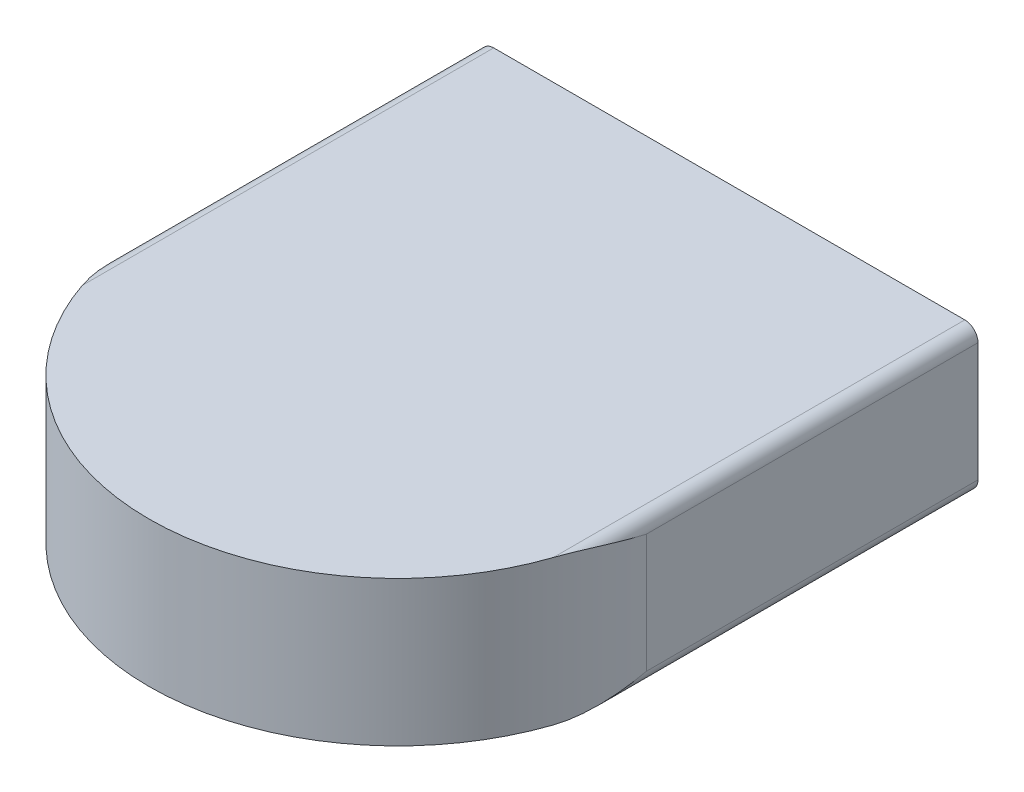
ISO-10303-21;
HEADER;
FILE_DESCRIPTION(('STEP AP214'),'2;1');
FILE_NAME('part.step','',(''),(''),'','','');
FILE_SCHEMA(('AUTOMOTIVE_DESIGN { 1 0 10303 214 1 1 1 1 }'));
ENDSEC;
DATA;
#1=APPLICATION_CONTEXT('core data for automotive mechanical design processes');
#2=APPLICATION_PROTOCOL_DEFINITION('international standard','automotive_design',2000,#1);
#3=PRODUCT_CONTEXT('',#1,'mechanical');
#4=PRODUCT('Part','Part','',(#3));
#5=PRODUCT_RELATED_PRODUCT_CATEGORY('part','',(#4));
#6=PRODUCT_DEFINITION_FORMATION('','',#4);
#7=PRODUCT_DEFINITION_CONTEXT('part definition',#1,'design');
#8=PRODUCT_DEFINITION('design','',#6,#7);
#9=PRODUCT_DEFINITION_SHAPE('','',#8);
#10=(LENGTH_UNIT() NAMED_UNIT(*) SI_UNIT(.MILLI.,.METRE.));
#11=(NAMED_UNIT(*) PLANE_ANGLE_UNIT() SI_UNIT($,.RADIAN.));
#12=(NAMED_UNIT(*) SI_UNIT($,.STERADIAN.) SOLID_ANGLE_UNIT());
#13=UNCERTAINTY_MEASURE_WITH_UNIT(LENGTH_MEASURE(1.E-05),#10,'distance_accuracy_value','');
#14=(GEOMETRIC_REPRESENTATION_CONTEXT(3) GLOBAL_UNCERTAINTY_ASSIGNED_CONTEXT((#13)) GLOBAL_UNIT_ASSIGNED_CONTEXT((#10,
#11,#12)) REPRESENTATION_CONTEXT('',''));
#15=CARTESIAN_POINT('',(0.,0.,0.));
#16=DIRECTION('',(0.,0.,1.));
#17=DIRECTION('',(1.,0.,0.));
#18=AXIS2_PLACEMENT_3D('',#15,#16,#17);
#19=CARTESIAN_POINT('',(-30.,8.75,0.));
#20=DIRECTION('',(1.,0.,0.));
#21=DIRECTION('',(0.,0.,-1.));
#22=AXIS2_PLACEMENT_3D('',#19,#20,#21);
#23=PLANE('',#22);
#24=DIRECTION('',(0.,-1.,0.));
#25=VECTOR('',#24,1.);
#26=CARTESIAN_POINT('',(-30.,8.75,0.));
#27=LINE('',#26,#25);
#28=CARTESIAN_POINT('',(-30.,7.16199999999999,0.));
#29=VERTEX_POINT('',#28);
#30=CARTESIAN_POINT('',(-30.,-7.16199999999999,0.));
#31=VERTEX_POINT('',#30);
#32=EDGE_CURVE('E126',#29,#31,#27,.T.);
#33=ORIENTED_EDGE('',*,*,#32,.F.);
#34=DIRECTION('',(0.,0.,-1.));
#35=VECTOR('',#34,1.);
#36=CARTESIAN_POINT('',(-30.,7.16199999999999,30.));
#37=LINE('',#36,#35);
#38=CARTESIAN_POINT('',(-30.,7.16199999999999,-40.));
#39=VERTEX_POINT('',#38);
#40=EDGE_CURVE('E195',#29,#39,#37,.T.);
#41=ORIENTED_EDGE('',*,*,#40,.T.);
#42=DIRECTION('',(0.,-1.,0.));
#43=VECTOR('',#42,1.);
#44=CARTESIAN_POINT('',(-30.,8.75,-40.));
#45=LINE('',#44,#43);
#46=CARTESIAN_POINT('',(-30.,-7.16199999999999,-40.));
#47=VERTEX_POINT('',#46);
#48=EDGE_CURVE('E124',#39,#47,#45,.T.);
#49=ORIENTED_EDGE('',*,*,#48,.T.);
#50=DIRECTION('',(0.,0.,-1.));
#51=VECTOR('',#50,1.);
#52=CARTESIAN_POINT('',(-30.,-7.16199999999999,30.));
#53=LINE('',#52,#51);
#54=EDGE_CURVE('E119',#31,#47,#53,.T.);
#55=ORIENTED_EDGE('',*,*,#54,.F.);
#56=EDGE_LOOP('',(#33,#41,#49,#55));
#57=FACE_BOUND('',#56,.T.);
#58=ADVANCED_FACE('F34',(#57),#23,.F.);
#59=CARTESIAN_POINT('',(0.,8.75,0.));
#60=DIRECTION('',(0.,-1.,0.));
#61=DIRECTION('',(0.,0.,-1.));
#62=AXIS2_PLACEMENT_3D('',#59,#60,#61);
#63=CYLINDRICAL_SURFACE('',#62,30.);
#64=CARTESIAN_POINT('',(28.412,8.75,9.6311087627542));
#65=CARTESIAN_POINT('',(28.4547860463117,8.74999138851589,9.50489015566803));
#66=CARTESIAN_POINT('',(28.4967260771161,8.74827185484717,9.37839837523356));
#67=CARTESIAN_POINT('',(28.5788900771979,8.74174540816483,9.12495376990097));
#68=CARTESIAN_POINT('',(28.61911425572,8.7369388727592,8.99800100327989));
#69=CARTESIAN_POINT('',(28.7371358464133,8.71839852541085,8.61671532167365));
#70=CARTESIAN_POINT('',(28.8123437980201,8.70054299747,8.36177360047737));
#71=CARTESIAN_POINT('',(28.9556722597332,8.65591635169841,7.85107071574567));
#72=CARTESIAN_POINT('',(29.0238017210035,8.62915667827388,7.59531101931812));
#73=CARTESIAN_POINT('',(29.1530979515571,8.5682800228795,7.08284773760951));
#74=CARTESIAN_POINT('',(29.2142628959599,8.53416111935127,6.8261439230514));
#75=CARTESIAN_POINT('',(29.3326636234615,8.45789308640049,6.29854986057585));
#76=CARTESIAN_POINT('',(29.3895239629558,8.41541616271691,6.02762307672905));
#77=CARTESIAN_POINT('',(29.4955788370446,8.32495120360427,5.48518145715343));
#78=CARTESIAN_POINT('',(29.544772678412,8.27696267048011,5.21366657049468));
#79=CARTESIAN_POINT('',(29.6809486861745,8.1262956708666,4.3982996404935));
#80=CARTESIAN_POINT('',(29.7565012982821,8.0169321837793,3.8537327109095));
#81=CARTESIAN_POINT('',(29.8774945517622,7.78723649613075,2.76340708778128));
#82=CARTESIAN_POINT('',(29.9229206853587,7.66689904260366,2.2176479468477));
#83=CARTESIAN_POINT('',(29.9838509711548,7.42096935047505,1.12580981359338));
#84=CARTESIAN_POINT('',(29.9993666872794,7.29537916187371,0.579731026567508));
#85=CARTESIAN_POINT('',(29.9999936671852,7.16717800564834,0.0225059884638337));
#86=CARTESIAN_POINT('',(29.9999999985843,7.16458899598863,0.0112529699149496));
#87=CARTESIAN_POINT('',(30.,7.162,0.));
#88=B_SPLINE_CURVE_WITH_KNOTS('',3,(#64,#65,#66,#67,#68,#69,#70,#71,#72,#73,#74,#75,#76,#77,#78,
#79,#80,#81,#82,#83,#84,#85,#86,#87),.UNSPECIFIED.,.F.,.F.,(4,2,2,2,2,2,2,2,2,2,2,4),(0.,
0.399785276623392,0.799521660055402,1.59842041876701,2.39629630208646,3.19438077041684,
4.03440912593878,4.87451339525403,6.55505507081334,8.23640544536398,9.91710564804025,
9.95174666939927),.UNSPECIFIED.);
#89=CARTESIAN_POINT('',(28.412,8.75,9.63110876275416));
#90=VERTEX_POINT('',#89);
#91=CARTESIAN_POINT('',(30.,7.16199999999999,0.));
#92=VERTEX_POINT('',#91);
#93=EDGE_CURVE('E156',#90,#92,#88,.T.);
#94=ORIENTED_EDGE('',*,*,#93,.F.);
#95=CARTESIAN_POINT('',(0.,8.75,0.));
#96=DIRECTION('',(0.,1.,0.));
#97=DIRECTION('',(0.,0.,-1.));
#98=AXIS2_PLACEMENT_3D('',#95,#96,#97);
#99=CIRCLE('',#98,30.);
#100=CARTESIAN_POINT('',(-28.412,8.75,9.63110876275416));
#101=VERTEX_POINT('',#100);
#102=EDGE_CURVE('E149',#101,#90,#99,.T.);
#103=ORIENTED_EDGE('',*,*,#102,.F.);
#104=CARTESIAN_POINT('',(-28.412,8.75,9.6311087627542));
#105=CARTESIAN_POINT('',(-28.4547860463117,8.74999138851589,9.50489015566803));
#106=CARTESIAN_POINT('',(-28.4967260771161,8.74827185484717,9.37839837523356));
#107=CARTESIAN_POINT('',(-28.5788900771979,8.74174540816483,9.12495376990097));
#108=CARTESIAN_POINT('',(-28.61911425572,8.7369388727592,8.99800100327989));
#109=CARTESIAN_POINT('',(-28.7371358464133,8.71839852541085,8.61671532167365));
#110=CARTESIAN_POINT('',(-28.8123437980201,8.70054299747,8.36177360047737));
#111=CARTESIAN_POINT('',(-28.9556722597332,8.65591635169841,7.85107071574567));
#112=CARTESIAN_POINT('',(-29.0238017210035,8.62915667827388,7.59531101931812));
#113=CARTESIAN_POINT('',(-29.1530979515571,8.5682800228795,7.08284773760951));
#114=CARTESIAN_POINT('',(-29.2142628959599,8.53416111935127,6.8261439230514));
#115=CARTESIAN_POINT('',(-29.3326636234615,8.45789308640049,6.29854986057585));
#116=CARTESIAN_POINT('',(-29.3895239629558,8.41541616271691,6.02762307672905));
#117=CARTESIAN_POINT('',(-29.4955788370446,8.32495120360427,5.48518145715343));
#118=CARTESIAN_POINT('',(-29.544772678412,8.27696267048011,5.21366657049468));
#119=CARTESIAN_POINT('',(-29.6809486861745,8.1262956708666,4.3982996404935));
#120=CARTESIAN_POINT('',(-29.7565012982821,8.0169321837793,3.8537327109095));
#121=CARTESIAN_POINT('',(-29.8774945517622,7.78723649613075,2.76340708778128));
#122=CARTESIAN_POINT('',(-29.9229206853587,7.66689904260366,2.2176479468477));
#123=CARTESIAN_POINT('',(-29.9838509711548,7.42096935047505,1.12580981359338));
#124=CARTESIAN_POINT('',(-29.9993666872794,7.29537916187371,0.579731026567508));
#125=CARTESIAN_POINT('',(-29.9999936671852,7.16717800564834,0.0225059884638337));
#126=CARTESIAN_POINT('',(-29.9999999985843,7.16458899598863,0.0112529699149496));
#127=CARTESIAN_POINT('',(-30.,7.162,0.));
#128=B_SPLINE_CURVE_WITH_KNOTS('',3,(#104,#105,#106,#107,#108,#109,#110,#111,#112,#113,#114,
#115,#116,#117,#118,#119,#120,#121,#122,#123,#124,#125,#126,#127),.UNSPECIFIED.,.F.,.F.,(4,2,2,
2,2,2,2,2,2,2,2,4),(0.,0.399785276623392,0.799521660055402,1.59842041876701,2.39629630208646,
3.19438077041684,4.03440912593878,4.87451339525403,6.55505507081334,8.23640544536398,
9.91710564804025,9.95174666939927),.UNSPECIFIED.);
#129=EDGE_CURVE('E55',#29,#101,#128,.F.);
#130=ORIENTED_EDGE('',*,*,#129,.F.);
#131=ORIENTED_EDGE('',*,*,#32,.T.);
#132=CARTESIAN_POINT('',(-28.412,-8.75,9.6311087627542));
#133=CARTESIAN_POINT('',(-28.4547860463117,-8.74999138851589,9.50489015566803));
#134=CARTESIAN_POINT('',(-28.4967260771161,-8.74827185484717,9.37839837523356));
#135=CARTESIAN_POINT('',(-28.5788900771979,-8.74174540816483,9.12495376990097));
#136=CARTESIAN_POINT('',(-28.61911425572,-8.7369388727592,8.99800100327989));
#137=CARTESIAN_POINT('',(-28.7371358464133,-8.71839852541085,8.61671532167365));
#138=CARTESIAN_POINT('',(-28.8123437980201,-8.70054299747,8.36177360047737));
#139=CARTESIAN_POINT('',(-28.9556722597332,-8.65591635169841,7.85107071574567));
#140=CARTESIAN_POINT('',(-29.0238017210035,-8.62915667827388,7.59531101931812));
#141=CARTESIAN_POINT('',(-29.1530979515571,-8.5682800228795,7.08284773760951));
#142=CARTESIAN_POINT('',(-29.2142628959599,-8.53416111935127,6.8261439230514));
#143=CARTESIAN_POINT('',(-29.3326636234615,-8.45789308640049,6.29854986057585));
#144=CARTESIAN_POINT('',(-29.3895239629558,-8.41541616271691,6.02762307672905));
#145=CARTESIAN_POINT('',(-29.4955788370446,-8.32495120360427,5.48518145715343));
#146=CARTESIAN_POINT('',(-29.544772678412,-8.27696267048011,5.21366657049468));
#147=CARTESIAN_POINT('',(-29.6809486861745,-8.1262956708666,4.3982996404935));
#148=CARTESIAN_POINT('',(-29.7565012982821,-8.0169321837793,3.8537327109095));
#149=CARTESIAN_POINT('',(-29.8774945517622,-7.78723649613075,2.76340708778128));
#150=CARTESIAN_POINT('',(-29.9229206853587,-7.66689904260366,2.2176479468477));
#151=CARTESIAN_POINT('',(-29.9838509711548,-7.42096935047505,1.12580981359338));
#152=CARTESIAN_POINT('',(-29.9993666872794,-7.29537916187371,0.579731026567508));
#153=CARTESIAN_POINT('',(-29.9999936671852,-7.16717800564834,0.0225059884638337));
#154=CARTESIAN_POINT('',(-29.9999999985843,-7.16458899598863,0.0112529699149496));
#155=CARTESIAN_POINT('',(-30.,-7.162,0.));
#156=B_SPLINE_CURVE_WITH_KNOTS('',3,(#132,#133,#134,#135,#136,#137,#138,#139,#140,#141,#142,
#143,#144,#145,#146,#147,#148,#149,#150,#151,#152,#153,#154,#155),.UNSPECIFIED.,.F.,.F.,(4,2,2,
2,2,2,2,2,2,2,2,4),(0.,0.399785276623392,0.799521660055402,1.59842041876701,2.39629630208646,
3.19438077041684,4.03440912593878,4.87451339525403,6.55505507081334,8.23640544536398,
9.91710564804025,9.95174666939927),.UNSPECIFIED.);
#157=CARTESIAN_POINT('',(-28.412,-8.75,9.63110876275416));
#158=VERTEX_POINT('',#157);
#159=EDGE_CURVE('E198',#158,#31,#156,.T.);
#160=ORIENTED_EDGE('',*,*,#159,.F.);
#161=CARTESIAN_POINT('',(0.,-8.75,0.));
#162=DIRECTION('',(0.,1.,0.));
#163=DIRECTION('',(0.,0.,-1.));
#164=AXIS2_PLACEMENT_3D('',#161,#162,#163);
#165=CIRCLE('',#164,30.);
#166=CARTESIAN_POINT('',(28.412,-8.75,9.63110876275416));
#167=VERTEX_POINT('',#166);
#168=EDGE_CURVE('E154',#158,#167,#165,.T.);
#169=ORIENTED_EDGE('',*,*,#168,.T.);
#170=CARTESIAN_POINT('',(28.412,-8.75,9.6311087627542));
#171=CARTESIAN_POINT('',(28.4547860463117,-8.74999138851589,9.50489015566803));
#172=CARTESIAN_POINT('',(28.4967260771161,-8.74827185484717,9.37839837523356));
#173=CARTESIAN_POINT('',(28.5788900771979,-8.74174540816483,9.12495376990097));
#174=CARTESIAN_POINT('',(28.61911425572,-8.7369388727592,8.99800100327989));
#175=CARTESIAN_POINT('',(28.7371358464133,-8.71839852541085,8.61671532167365));
#176=CARTESIAN_POINT('',(28.8123437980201,-8.70054299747,8.36177360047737));
#177=CARTESIAN_POINT('',(28.9556722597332,-8.65591635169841,7.85107071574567));
#178=CARTESIAN_POINT('',(29.0238017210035,-8.62915667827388,7.59531101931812));
#179=CARTESIAN_POINT('',(29.1530979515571,-8.5682800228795,7.08284773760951));
#180=CARTESIAN_POINT('',(29.2142628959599,-8.53416111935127,6.8261439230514));
#181=CARTESIAN_POINT('',(29.3326636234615,-8.45789308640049,6.29854986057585));
#182=CARTESIAN_POINT('',(29.3895239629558,-8.41541616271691,6.02762307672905));
#183=CARTESIAN_POINT('',(29.4955788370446,-8.32495120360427,5.48518145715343));
#184=CARTESIAN_POINT('',(29.544772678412,-8.27696267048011,5.21366657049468));
#185=CARTESIAN_POINT('',(29.6809486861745,-8.1262956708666,4.3982996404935));
#186=CARTESIAN_POINT('',(29.7565012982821,-8.0169321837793,3.8537327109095));
#187=CARTESIAN_POINT('',(29.8774945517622,-7.78723649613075,2.76340708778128));
#188=CARTESIAN_POINT('',(29.9229206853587,-7.66689904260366,2.2176479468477));
#189=CARTESIAN_POINT('',(29.9838509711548,-7.42096935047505,1.12580981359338));
#190=CARTESIAN_POINT('',(29.9993666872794,-7.29537916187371,0.579731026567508));
#191=CARTESIAN_POINT('',(29.9999936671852,-7.16717800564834,0.0225059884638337));
#192=CARTESIAN_POINT('',(29.9999999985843,-7.16458899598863,0.0112529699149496));
#193=CARTESIAN_POINT('',(30.,-7.162,0.));
#194=B_SPLINE_CURVE_WITH_KNOTS('',3,(#170,#171,#172,#173,#174,#175,#176,#177,#178,#179,#180,
#181,#182,#183,#184,#185,#186,#187,#188,#189,#190,#191,#192,#193),.UNSPECIFIED.,.F.,.F.,(4,2,2,
2,2,2,2,2,2,2,2,4),(0.,0.399785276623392,0.799521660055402,1.59842041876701,2.39629630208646,
3.19438077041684,4.03440912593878,4.87451339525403,6.55505507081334,8.23640544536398,
9.91710564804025,9.95174666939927),.UNSPECIFIED.);
#195=CARTESIAN_POINT('',(30.,-7.16199999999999,0.));
#196=VERTEX_POINT('',#195);
#197=EDGE_CURVE('E200',#196,#167,#194,.F.);
#198=ORIENTED_EDGE('',*,*,#197,.F.);
#199=DIRECTION('',(0.,-1.,0.));
#200=VECTOR('',#199,1.);
#201=CARTESIAN_POINT('',(30.,8.75,0.));
#202=LINE('',#201,#200);
#203=EDGE_CURVE('E118',#92,#196,#202,.T.);
#204=ORIENTED_EDGE('',*,*,#203,.F.);
#205=EDGE_LOOP('',(#94,#103,#130,#131,#160,#169,#198,#204));
#206=FACE_BOUND('',#205,.T.);
#207=ADVANCED_FACE('F167',(#206),#63,.T.);
#208=CARTESIAN_POINT('',(30.,8.75,-40.));
#209=DIRECTION('',(-1.,0.,0.));
#210=DIRECTION('',(0.,0.,1.));
#211=AXIS2_PLACEMENT_3D('',#208,#209,#210);
#212=PLANE('',#211);
#213=DIRECTION('',(0.,0.,-1.));
#214=VECTOR('',#213,1.);
#215=CARTESIAN_POINT('',(30.,7.16199999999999,30.));
#216=LINE('',#215,#214);
#217=CARTESIAN_POINT('',(30.,7.16199999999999,-40.));
#218=VERTEX_POINT('',#217);
#219=EDGE_CURVE('E120',#92,#218,#216,.T.);
#220=ORIENTED_EDGE('',*,*,#219,.F.);
#221=ORIENTED_EDGE('',*,*,#203,.T.);
#222=DIRECTION('',(0.,0.,-1.));
#223=VECTOR('',#222,1.);
#224=CARTESIAN_POINT('',(30.,-7.16199999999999,30.));
#225=LINE('',#224,#223);
#226=CARTESIAN_POINT('',(30.,-7.16199999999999,-40.));
#227=VERTEX_POINT('',#226);
#228=EDGE_CURVE('E101',#196,#227,#225,.T.);
#229=ORIENTED_EDGE('',*,*,#228,.T.);
#230=DIRECTION('',(0.,-1.,0.));
#231=VECTOR('',#230,1.);
#232=CARTESIAN_POINT('',(30.,8.75,-40.));
#233=LINE('',#232,#231);
#234=EDGE_CURVE('E116',#218,#227,#233,.T.);
#235=ORIENTED_EDGE('',*,*,#234,.F.);
#236=EDGE_LOOP('',(#220,#221,#229,#235));
#237=FACE_BOUND('',#236,.T.);
#238=ADVANCED_FACE('F115',(#237),#212,.F.);
#239=CARTESIAN_POINT('',(-30.,8.75,-40.));
#240=DIRECTION('',(0.,0.,1.));
#241=DIRECTION('',(1.,0.,0.));
#242=AXIS2_PLACEMENT_3D('',#239,#240,#241);
#243=PLANE('',#242);
#244=CARTESIAN_POINT('',(28.412,7.162,-40.));
#245=DIRECTION('',(0.,0.,-1.));
#246=DIRECTION('',(-1.,0.,0.));
#247=AXIS2_PLACEMENT_3D('',#244,#245,#246);
#248=CIRCLE('',#247,1.588);
#249=CARTESIAN_POINT('',(28.412,8.75,-40.));
#250=VERTEX_POINT('',#249);
#251=EDGE_CURVE('E48',#250,#218,#248,.T.);
#252=ORIENTED_EDGE('',*,*,#251,.T.);
#253=ORIENTED_EDGE('',*,*,#234,.T.);
#254=CARTESIAN_POINT('',(28.412,-7.162,-40.));
#255=DIRECTION('',(0.,0.,-1.));
#256=DIRECTION('',(-1.,0.,0.));
#257=AXIS2_PLACEMENT_3D('',#254,#255,#256);
#258=CIRCLE('',#257,1.588);
#259=CARTESIAN_POINT('',(28.412,-8.75,-40.));
#260=VERTEX_POINT('',#259);
#261=EDGE_CURVE('E97',#227,#260,#258,.T.);
#262=ORIENTED_EDGE('',*,*,#261,.T.);
#263=DIRECTION('',(-1.,0.,0.));
#264=VECTOR('',#263,1.);
#265=CARTESIAN_POINT('',(-30.,-8.75,-40.));
#266=LINE('',#265,#264);
#267=CARTESIAN_POINT('',(-28.412,-8.75,-40.));
#268=VERTEX_POINT('',#267);
#269=EDGE_CURVE('E150',#260,#268,#266,.T.);
#270=ORIENTED_EDGE('',*,*,#269,.T.);
#271=CARTESIAN_POINT('',(-28.412,-7.162,-40.));
#272=DIRECTION('',(0.,0.,-1.));
#273=DIRECTION('',(-1.,0.,0.));
#274=AXIS2_PLACEMENT_3D('',#271,#272,#273);
#275=CIRCLE('',#274,1.588);
#276=EDGE_CURVE('E109',#268,#47,#275,.T.);
#277=ORIENTED_EDGE('',*,*,#276,.T.);
#278=ORIENTED_EDGE('',*,*,#48,.F.);
#279=CARTESIAN_POINT('',(-28.412,7.162,-40.));
#280=DIRECTION('',(0.,0.,-1.));
#281=DIRECTION('',(1.,0.,0.));
#282=AXIS2_PLACEMENT_3D('',#279,#280,#281);
#283=CIRCLE('',#282,1.588);
#284=CARTESIAN_POINT('',(-28.412,8.75,-40.));
#285=VERTEX_POINT('',#284);
#286=EDGE_CURVE('E140',#39,#285,#283,.T.);
#287=ORIENTED_EDGE('',*,*,#286,.T.);
#288=DIRECTION('',(-1.,0.,0.));
#289=VECTOR('',#288,1.);
#290=CARTESIAN_POINT('',(-30.,8.75,-40.));
#291=LINE('',#290,#289);
#292=EDGE_CURVE('E129',#250,#285,#291,.T.);
#293=ORIENTED_EDGE('',*,*,#292,.F.);
#294=EDGE_LOOP('',(#252,#253,#262,#270,#277,#278,#287,#293));
#295=FACE_BOUND('',#294,.T.);
#296=ADVANCED_FACE('F122',(#295),#243,.F.);
#297=CARTESIAN_POINT('',(0.,8.75,0.));
#298=DIRECTION('',(0.,-1.,0.));
#299=DIRECTION('',(0.,0.,-1.));
#300=AXIS2_PLACEMENT_3D('',#297,#298,#299);
#301=PLANE('',#300);
#302=ORIENTED_EDGE('',*,*,#102,.T.);
#303=DIRECTION('',(0.,0.,-1.));
#304=VECTOR('',#303,1.);
#305=CARTESIAN_POINT('',(28.412,8.75,30.));
#306=LINE('',#305,#304);
#307=EDGE_CURVE('E12',#90,#250,#306,.T.);
#308=ORIENTED_EDGE('',*,*,#307,.T.);
#309=ORIENTED_EDGE('',*,*,#292,.T.);
#310=DIRECTION('',(0.,0.,-1.));
#311=VECTOR('',#310,1.);
#312=CARTESIAN_POINT('',(-28.412,8.75,30.));
#313=LINE('',#312,#311);
#314=EDGE_CURVE('E41',#101,#285,#313,.T.);
#315=ORIENTED_EDGE('',*,*,#314,.F.);
#316=EDGE_LOOP('',(#302,#308,#309,#315));
#317=FACE_BOUND('',#316,.T.);
#318=ADVANCED_FACE('F148',(#317),#301,.F.);
#319=CARTESIAN_POINT('',(0.,-8.75,0.));
#320=DIRECTION('',(0.,-1.,0.));
#321=DIRECTION('',(0.,0.,-1.));
#322=AXIS2_PLACEMENT_3D('',#319,#320,#321);
#323=PLANE('',#322);
#324=ORIENTED_EDGE('',*,*,#168,.F.);
#325=DIRECTION('',(0.,0.,-1.));
#326=VECTOR('',#325,1.);
#327=CARTESIAN_POINT('',(-28.412,-8.75,30.));
#328=LINE('',#327,#326);
#329=EDGE_CURVE('E136',#158,#268,#328,.T.);
#330=ORIENTED_EDGE('',*,*,#329,.T.);
#331=ORIENTED_EDGE('',*,*,#269,.F.);
#332=DIRECTION('',(0.,0.,-1.));
#333=VECTOR('',#332,1.);
#334=CARTESIAN_POINT('',(28.412,-8.75,30.));
#335=LINE('',#334,#333);
#336=EDGE_CURVE('E104',#167,#260,#335,.T.);
#337=ORIENTED_EDGE('',*,*,#336,.F.);
#338=EDGE_LOOP('',(#324,#330,#331,#337));
#339=FACE_BOUND('',#338,.T.);
#340=ADVANCED_FACE('F177',(#339),#323,.T.);
#341=CARTESIAN_POINT('',(28.412,-7.162,30.));
#342=DIRECTION('',(0.,0.,-1.));
#343=DIRECTION('',(-1.,0.,0.));
#344=AXIS2_PLACEMENT_3D('',#341,#342,#343);
#345=CYLINDRICAL_SURFACE('',#344,1.588);
#346=ORIENTED_EDGE('',*,*,#197,.T.);
#347=ORIENTED_EDGE('',*,*,#336,.T.);
#348=ORIENTED_EDGE('',*,*,#261,.F.);
#349=ORIENTED_EDGE('',*,*,#228,.F.);
#350=EDGE_LOOP('',(#346,#347,#348,#349));
#351=FACE_BOUND('',#350,.T.);
#352=ADVANCED_FACE('F100',(#351),#345,.T.);
#353=CARTESIAN_POINT('',(-28.412,-7.162,30.));
#354=DIRECTION('',(0.,0.,-1.));
#355=DIRECTION('',(-1.,0.,0.));
#356=AXIS2_PLACEMENT_3D('',#353,#354,#355);
#357=CYLINDRICAL_SURFACE('',#356,1.588);
#358=ORIENTED_EDGE('',*,*,#159,.T.);
#359=ORIENTED_EDGE('',*,*,#54,.T.);
#360=ORIENTED_EDGE('',*,*,#276,.F.);
#361=ORIENTED_EDGE('',*,*,#329,.F.);
#362=EDGE_LOOP('',(#358,#359,#360,#361));
#363=FACE_BOUND('',#362,.T.);
#364=ADVANCED_FACE('F210',(#363),#357,.T.);
#365=CARTESIAN_POINT('',(-28.412,7.162,30.));
#366=DIRECTION('',(0.,0.,-1.));
#367=DIRECTION('',(-1.,0.,0.));
#368=AXIS2_PLACEMENT_3D('',#365,#366,#367);
#369=CYLINDRICAL_SURFACE('',#368,1.588);
#370=ORIENTED_EDGE('',*,*,#129,.T.);
#371=ORIENTED_EDGE('',*,*,#314,.T.);
#372=ORIENTED_EDGE('',*,*,#286,.F.);
#373=ORIENTED_EDGE('',*,*,#40,.F.);
#374=EDGE_LOOP('',(#370,#371,#372,#373));
#375=FACE_BOUND('',#374,.T.);
#376=ADVANCED_FACE('F139',(#375),#369,.T.);
#377=CARTESIAN_POINT('',(28.412,7.162,30.));
#378=DIRECTION('',(0.,0.,-1.));
#379=DIRECTION('',(-1.,0.,0.));
#380=AXIS2_PLACEMENT_3D('',#377,#378,#379);
#381=CYLINDRICAL_SURFACE('',#380,1.588);
#382=ORIENTED_EDGE('',*,*,#93,.T.);
#383=ORIENTED_EDGE('',*,*,#219,.T.);
#384=ORIENTED_EDGE('',*,*,#251,.F.);
#385=ORIENTED_EDGE('',*,*,#307,.F.);
#386=EDGE_LOOP('',(#382,#383,#384,#385));
#387=FACE_BOUND('',#386,.T.);
#388=ADVANCED_FACE('F170',(#387),#381,.T.);
#389=CLOSED_SHELL('',(#58,#207,#238,#296,#318,#340,#352,#364,#376,#388));
#390=MANIFOLD_SOLID_BREP('B2',#389);
#391=ADVANCED_BREP_SHAPE_REPRESENTATION('',(#18,#390),#14);
#392=SHAPE_DEFINITION_REPRESENTATION(#9,#391);
ENDSEC;
END-ISO-10303-21;
